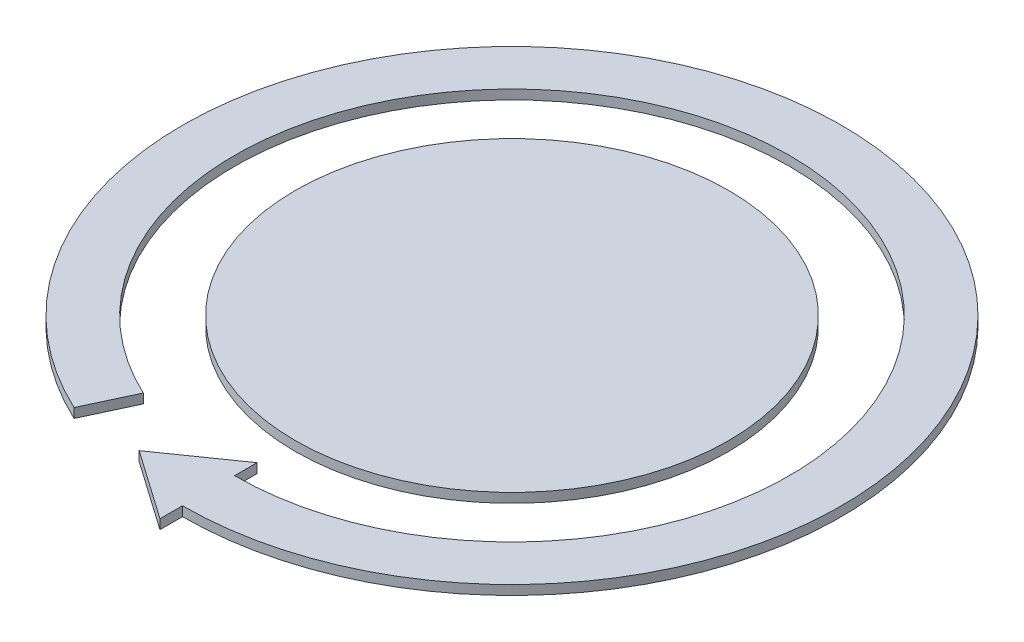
ISO-10303-21;
HEADER;
FILE_DESCRIPTION(('STEP AP214'),'2;1');
FILE_NAME('part.step','',(''),(''),'','','');
FILE_SCHEMA(('AUTOMOTIVE_DESIGN { 1 0 10303 214 1 1 1 1 }'));
ENDSEC;
DATA;
#1=APPLICATION_CONTEXT('core data for automotive mechanical design processes');
#2=APPLICATION_PROTOCOL_DEFINITION('international standard','automotive_design',2000,#1);
#3=PRODUCT_CONTEXT('',#1,'mechanical');
#4=PRODUCT('Part','Part','',(#3));
#5=PRODUCT_RELATED_PRODUCT_CATEGORY('part','',(#4));
#6=PRODUCT_DEFINITION_FORMATION('','',#4);
#7=PRODUCT_DEFINITION_CONTEXT('part definition',#1,'design');
#8=PRODUCT_DEFINITION('design','',#6,#7);
#9=PRODUCT_DEFINITION_SHAPE('','',#8);
#10=(LENGTH_UNIT() NAMED_UNIT(*) SI_UNIT(.MILLI.,.METRE.));
#11=(NAMED_UNIT(*) PLANE_ANGLE_UNIT() SI_UNIT($,.RADIAN.));
#12=(NAMED_UNIT(*) SI_UNIT($,.STERADIAN.) SOLID_ANGLE_UNIT());
#13=UNCERTAINTY_MEASURE_WITH_UNIT(LENGTH_MEASURE(1.E-05),#10,'distance_accuracy_value','');
#14=(GEOMETRIC_REPRESENTATION_CONTEXT(3) GLOBAL_UNCERTAINTY_ASSIGNED_CONTEXT((#13)) GLOBAL_UNIT_ASSIGNED_CONTEXT((#10,
#11,#12)) REPRESENTATION_CONTEXT('',''));
#15=CARTESIAN_POINT('',(0.,0.,0.));
#16=DIRECTION('',(0.,0.,1.));
#17=DIRECTION('',(1.,0.,0.));
#18=AXIS2_PLACEMENT_3D('',#15,#16,#17);
#19=CARTESIAN_POINT('',(0.,2.,0.));
#20=DIRECTION('',(0.,-1.,0.));
#21=DIRECTION('',(0.,0.,-1.));
#22=AXIS2_PLACEMENT_3D('',#19,#20,#21);
#23=CYLINDRICAL_SURFACE('',#22,58.575);
#24=CARTESIAN_POINT('',(0.,0.,0.));
#25=DIRECTION('',(0.,-1.,0.));
#26=DIRECTION('',(0.,0.,1.));
#27=AXIS2_PLACEMENT_3D('',#24,#25,#26);
#28=CIRCLE('',#27,58.575);
#29=CARTESIAN_POINT('',(-24.7547550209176,0.,53.0870297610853));
#30=VERTEX_POINT('',#29);
#31=CARTESIAN_POINT('',(0.,0.,58.575));
#32=VERTEX_POINT('',#31);
#33=EDGE_CURVE('E133',#30,#32,#28,.T.);
#34=ORIENTED_EDGE('',*,*,#33,.T.);
#35=DIRECTION('',(0.,-1.,0.));
#36=VECTOR('',#35,1.);
#37=CARTESIAN_POINT('',(0.,2.,58.575));
#38=LINE('',#37,#36);
#39=CARTESIAN_POINT('',(0.,2.,58.575));
#40=VERTEX_POINT('',#39);
#41=EDGE_CURVE('E12',#40,#32,#38,.T.);
#42=ORIENTED_EDGE('',*,*,#41,.F.);
#43=CARTESIAN_POINT('',(0.,2.,0.));
#44=DIRECTION('',(0.,-1.,0.));
#45=DIRECTION('',(0.,0.,1.));
#46=AXIS2_PLACEMENT_3D('',#43,#44,#45);
#47=CIRCLE('',#46,58.575);
#48=CARTESIAN_POINT('',(-24.7547550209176,2.,53.0870297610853));
#49=VERTEX_POINT('',#48);
#50=EDGE_CURVE('E145',#49,#40,#47,.T.);
#51=ORIENTED_EDGE('',*,*,#50,.F.);
#52=DIRECTION('',(0.,-1.,0.));
#53=VECTOR('',#52,1.);
#54=CARTESIAN_POINT('',(-24.7547550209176,2.,53.0870297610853));
#55=LINE('',#54,#53);
#56=EDGE_CURVE('E129',#49,#30,#55,.T.);
#57=ORIENTED_EDGE('',*,*,#56,.T.);
#58=EDGE_LOOP('',(#34,#42,#51,#57));
#59=FACE_BOUND('',#58,.T.);
#60=ADVANCED_FACE('F43',(#59),#23,.F.);
#61=CARTESIAN_POINT('',(0.,2.,58.575));
#62=DIRECTION('',(-1.,0.,0.));
#63=DIRECTION('',(0.,0.,1.));
#64=AXIS2_PLACEMENT_3D('',#61,#62,#63);
#65=PLANE('',#64);
#66=DIRECTION('',(0.,0.,-1.));
#67=VECTOR('',#66,1.);
#68=CARTESIAN_POINT('',(0.,0.,58.575));
#69=LINE('',#68,#67);
#70=CARTESIAN_POINT('',(-1.11022302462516E-13,0.,53.8204345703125));
#71=VERTEX_POINT('',#70);
#72=EDGE_CURVE('E136',#32,#71,#69,.T.);
#73=ORIENTED_EDGE('',*,*,#72,.T.);
#74=DIRECTION('',(0.,-1.,0.));
#75=VECTOR('',#74,1.);
#76=CARTESIAN_POINT('',(-1.11022302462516E-13,2.,53.8204345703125));
#77=LINE('',#76,#75);
#78=CARTESIAN_POINT('',(-1.11022302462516E-13,2.,53.8204345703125));
#79=VERTEX_POINT('',#78);
#80=EDGE_CURVE('E51',#79,#71,#77,.T.);
#81=ORIENTED_EDGE('',*,*,#80,.F.);
#82=DIRECTION('',(0.,0.,-1.));
#83=VECTOR('',#82,1.);
#84=CARTESIAN_POINT('',(0.,2.,58.575));
#85=LINE('',#84,#83);
#86=EDGE_CURVE('E99',#40,#79,#85,.T.);
#87=ORIENTED_EDGE('',*,*,#86,.F.);
#88=ORIENTED_EDGE('',*,*,#41,.T.);
#89=EDGE_LOOP('',(#73,#81,#87,#88));
#90=FACE_BOUND('',#89,.T.);
#91=ADVANCED_FACE('F170',(#90),#65,.F.);
#92=CARTESIAN_POINT('',(-14.6406090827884,2.,64.0718994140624));
#93=DIRECTION('',(0.573576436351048,0.,0.819152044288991));
#94=DIRECTION('',(0.819152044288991,0.,-0.573576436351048));
#95=AXIS2_PLACEMENT_3D('',#92,#93,#94);
#96=PLANE('',#95);
#97=DIRECTION('',(-0.819152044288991,0.,0.573576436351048));
#98=VECTOR('',#97,1.);
#99=CARTESIAN_POINT('',(-14.6406090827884,0.,64.0718994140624));
#100=LINE('',#99,#98);
#101=CARTESIAN_POINT('',(-14.6406090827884,0.,64.0718994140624));
#102=VERTEX_POINT('',#101);
#103=EDGE_CURVE('E138',#71,#102,#100,.T.);
#104=ORIENTED_EDGE('',*,*,#103,.T.);
#105=DIRECTION('',(0.,-1.,0.));
#106=VECTOR('',#105,1.);
#107=CARTESIAN_POINT('',(-14.6406090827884,2.,64.0718994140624));
#108=LINE('',#107,#106);
#109=CARTESIAN_POINT('',(-14.6406090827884,2.,64.0718994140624));
#110=VERTEX_POINT('',#109);
#111=EDGE_CURVE('E149',#110,#102,#108,.T.);
#112=ORIENTED_EDGE('',*,*,#111,.F.);
#113=DIRECTION('',(-0.819152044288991,0.,0.573576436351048));
#114=VECTOR('',#113,1.);
#115=CARTESIAN_POINT('',(-14.6406090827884,2.,64.0718994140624));
#116=LINE('',#115,#114);
#117=EDGE_CURVE('E157',#79,#110,#116,.T.);
#118=ORIENTED_EDGE('',*,*,#117,.F.);
#119=ORIENTED_EDGE('',*,*,#80,.T.);
#120=EDGE_LOOP('',(#104,#112,#118,#119));
#121=FACE_BOUND('',#120,.T.);
#122=ADVANCED_FACE('F155',(#121),#96,.F.);
#123=CARTESIAN_POINT('',(-14.6406090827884,2.,64.0718994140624));
#124=DIRECTION('',(0.57357643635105,0.,-0.819152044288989));
#125=DIRECTION('',(-0.819152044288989,0.,-0.57357643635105));
#126=AXIS2_PLACEMENT_3D('',#123,#124,#125);
#127=PLANE('',#126);
#128=DIRECTION('',(0.819152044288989,0.,0.57357643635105));
#129=VECTOR('',#128,1.);
#130=CARTESIAN_POINT('',(-14.6406090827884,0.,64.0718994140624));
#131=LINE('',#130,#129);
#132=CARTESIAN_POINT('',(0.,0.,74.3233642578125));
#133=VERTEX_POINT('',#132);
#134=EDGE_CURVE('E140',#102,#133,#131,.T.);
#135=ORIENTED_EDGE('',*,*,#134,.T.);
#136=DIRECTION('',(0.,-1.,0.));
#137=VECTOR('',#136,1.);
#138=CARTESIAN_POINT('',(0.,2.,74.3233642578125));
#139=LINE('',#138,#137);
#140=CARTESIAN_POINT('',(0.,2.,74.3233642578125));
#141=VERTEX_POINT('',#140);
#142=EDGE_CURVE('E124',#141,#133,#139,.T.);
#143=ORIENTED_EDGE('',*,*,#142,.F.);
#144=DIRECTION('',(0.819152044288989,0.,0.57357643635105));
#145=VECTOR('',#144,1.);
#146=CARTESIAN_POINT('',(-14.6406090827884,2.,64.0718994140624));
#147=LINE('',#146,#145);
#148=EDGE_CURVE('E115',#110,#141,#147,.T.);
#149=ORIENTED_EDGE('',*,*,#148,.F.);
#150=ORIENTED_EDGE('',*,*,#111,.T.);
#151=EDGE_LOOP('',(#135,#143,#149,#150));
#152=FACE_BOUND('',#151,.T.);
#153=ADVANCED_FACE('F163',(#152),#127,.F.);
#154=CARTESIAN_POINT('',(0.,2.,74.3233642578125));
#155=DIRECTION('',(-1.,0.,0.));
#156=DIRECTION('',(0.,0.,1.));
#157=AXIS2_PLACEMENT_3D('',#154,#155,#156);
#158=PLANE('',#157);
#159=DIRECTION('',(0.,0.,-1.));
#160=VECTOR('',#159,1.);
#161=CARTESIAN_POINT('',(0.,0.,74.3233642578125));
#162=LINE('',#161,#160);
#163=CARTESIAN_POINT('',(0.,0.,69.575));
#164=VERTEX_POINT('',#163);
#165=EDGE_CURVE('E123',#133,#164,#162,.T.);
#166=ORIENTED_EDGE('',*,*,#165,.T.);
#167=DIRECTION('',(0.,-1.,0.));
#168=VECTOR('',#167,1.);
#169=CARTESIAN_POINT('',(0.,2.,69.575));
#170=LINE('',#169,#168);
#171=CARTESIAN_POINT('',(0.,2.,69.575));
#172=VERTEX_POINT('',#171);
#173=EDGE_CURVE('E120',#172,#164,#170,.T.);
#174=ORIENTED_EDGE('',*,*,#173,.F.);
#175=DIRECTION('',(0.,0.,-1.));
#176=VECTOR('',#175,1.);
#177=CARTESIAN_POINT('',(0.,2.,74.3233642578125));
#178=LINE('',#177,#176);
#179=EDGE_CURVE('E109',#141,#172,#178,.T.);
#180=ORIENTED_EDGE('',*,*,#179,.F.);
#181=ORIENTED_EDGE('',*,*,#142,.T.);
#182=EDGE_LOOP('',(#166,#174,#180,#181));
#183=FACE_BOUND('',#182,.T.);
#184=ADVANCED_FACE('F121',(#183),#158,.F.);
#185=CARTESIAN_POINT('',(0.,2.,0.));
#186=DIRECTION('',(0.,-1.,0.));
#187=DIRECTION('',(0.,0.,-1.));
#188=AXIS2_PLACEMENT_3D('',#185,#186,#187);
#189=CYLINDRICAL_SURFACE('',#188,69.575);
#190=CARTESIAN_POINT('',(0.,0.,0.));
#191=DIRECTION('',(0.,1.,0.));
#192=DIRECTION('',(0.,0.,1.));
#193=AXIS2_PLACEMENT_3D('',#190,#191,#192);
#194=CIRCLE('',#193,69.575);
#195=CARTESIAN_POINT('',(-29.4035353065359,0.,63.056425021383));
#196=VERTEX_POINT('',#195);
#197=EDGE_CURVE('E85',#164,#196,#194,.T.);
#198=ORIENTED_EDGE('',*,*,#197,.T.);
#199=DIRECTION('',(0.,-1.,0.));
#200=VECTOR('',#199,1.);
#201=CARTESIAN_POINT('',(-29.4035353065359,2.,63.056425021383));
#202=LINE('',#201,#200);
#203=CARTESIAN_POINT('',(-29.4035353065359,2.,63.056425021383));
#204=VERTEX_POINT('',#203);
#205=EDGE_CURVE('E125',#204,#196,#202,.T.);
#206=ORIENTED_EDGE('',*,*,#205,.F.);
#207=CARTESIAN_POINT('',(0.,2.,0.));
#208=DIRECTION('',(0.,1.,0.));
#209=DIRECTION('',(0.,0.,1.));
#210=AXIS2_PLACEMENT_3D('',#207,#208,#209);
#211=CIRCLE('',#210,69.575);
#212=EDGE_CURVE('E113',#172,#204,#211,.T.);
#213=ORIENTED_EDGE('',*,*,#212,.F.);
#214=ORIENTED_EDGE('',*,*,#173,.T.);
#215=EDGE_LOOP('',(#198,#206,#213,#214));
#216=FACE_BOUND('',#215,.T.);
#217=ADVANCED_FACE('F127',(#216),#189,.T.);
#218=CARTESIAN_POINT('',(-24.7547550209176,2.,53.0870297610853));
#219=DIRECTION('',(-0.906308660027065,0.,-0.422616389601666));
#220=DIRECTION('',(-0.422616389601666,0.,0.906308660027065));
#221=AXIS2_PLACEMENT_3D('',#218,#219,#220);
#222=PLANE('',#221);
#223=DIRECTION('',(0.422616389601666,0.,-0.906308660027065));
#224=VECTOR('',#223,1.);
#225=CARTESIAN_POINT('',(-24.7547550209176,0.,53.0870297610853));
#226=LINE('',#225,#224);
#227=EDGE_CURVE('E91',#196,#30,#226,.T.);
#228=ORIENTED_EDGE('',*,*,#227,.T.);
#229=ORIENTED_EDGE('',*,*,#56,.F.);
#230=DIRECTION('',(0.422616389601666,0.,-0.906308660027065));
#231=VECTOR('',#230,1.);
#232=CARTESIAN_POINT('',(-24.7547550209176,2.,53.0870297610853));
#233=LINE('',#232,#231);
#234=EDGE_CURVE('E59',#204,#49,#233,.T.);
#235=ORIENTED_EDGE('',*,*,#234,.F.);
#236=ORIENTED_EDGE('',*,*,#205,.T.);
#237=EDGE_LOOP('',(#228,#229,#235,#236));
#238=FACE_BOUND('',#237,.T.);
#239=ADVANCED_FACE('F184',(#238),#222,.F.);
#240=CARTESIAN_POINT('',(0.,2.,0.));
#241=DIRECTION('',(0.,1.,0.));
#242=DIRECTION('',(0.,0.,1.));
#243=AXIS2_PLACEMENT_3D('',#240,#241,#242);
#244=PLANE('',#243);
#245=ORIENTED_EDGE('',*,*,#50,.T.);
#246=ORIENTED_EDGE('',*,*,#86,.T.);
#247=ORIENTED_EDGE('',*,*,#117,.T.);
#248=ORIENTED_EDGE('',*,*,#148,.T.);
#249=ORIENTED_EDGE('',*,*,#179,.T.);
#250=ORIENTED_EDGE('',*,*,#212,.T.);
#251=ORIENTED_EDGE('',*,*,#234,.T.);
#252=EDGE_LOOP('',(#245,#246,#247,#248,#249,#250,#251));
#253=FACE_BOUND('',#252,.T.);
#254=ADVANCED_FACE('F111',(#253),#244,.T.);
#255=CARTESIAN_POINT('',(0.,0.,0.));
#256=DIRECTION('',(0.,1.,0.));
#257=DIRECTION('',(0.,0.,1.));
#258=AXIS2_PLACEMENT_3D('',#255,#256,#257);
#259=PLANE('',#258);
#260=ORIENTED_EDGE('',*,*,#33,.F.);
#261=ORIENTED_EDGE('',*,*,#227,.F.);
#262=ORIENTED_EDGE('',*,*,#197,.F.);
#263=ORIENTED_EDGE('',*,*,#165,.F.);
#264=ORIENTED_EDGE('',*,*,#134,.F.);
#265=ORIENTED_EDGE('',*,*,#103,.F.);
#266=ORIENTED_EDGE('',*,*,#72,.F.);
#267=EDGE_LOOP('',(#260,#261,#262,#263,#264,#265,#266));
#268=FACE_BOUND('',#267,.T.);
#269=ADVANCED_FACE('F161',(#268),#259,.F.);
#270=CLOSED_SHELL('',(#60,#91,#122,#153,#184,#217,#239,#254,#269));
#271=MANIFOLD_SOLID_BREP('B2',#270);
#272=CARTESIAN_POINT('',(0.,2.,0.));
#273=DIRECTION('',(0.,-1.,0.));
#274=DIRECTION('',(0.,0.,-1.));
#275=AXIS2_PLACEMENT_3D('',#272,#273,#274);
#276=CYLINDRICAL_SURFACE('',#275,45.75);
#277=CARTESIAN_POINT('',(0.,2.,0.));
#278=DIRECTION('',(0.,1.,0.));
#279=DIRECTION('',(0.,0.,1.));
#280=AXIS2_PLACEMENT_3D('',#277,#278,#279);
#281=CIRCLE('',#280,45.75);
#282=CARTESIAN_POINT('',(0.,2.,45.75));
#283=VERTEX_POINT('',#282);
#284=EDGE_CURVE('E42',#283,#283,#281,.T.);
#285=ORIENTED_EDGE('',*,*,#284,.F.);
#286=EDGE_LOOP('',(#285));
#287=FACE_BOUND('',#286,.T.);
#288=CARTESIAN_POINT('',(0.,0.,0.));
#289=DIRECTION('',(0.,1.,0.));
#290=DIRECTION('',(0.,0.,1.));
#291=AXIS2_PLACEMENT_3D('',#288,#289,#290);
#292=CIRCLE('',#291,45.75);
#293=CARTESIAN_POINT('',(0.,0.,45.75));
#294=VERTEX_POINT('',#293);
#295=EDGE_CURVE('E248',#294,#294,#292,.T.);
#296=ORIENTED_EDGE('',*,*,#295,.T.);
#297=EDGE_LOOP('',(#296));
#298=FACE_BOUND('',#297,.T.);
#299=ADVANCED_FACE('F245',(#287,#298),#276,.T.);
#300=CARTESIAN_POINT('',(0.,2.,0.));
#301=DIRECTION('',(0.,1.,0.));
#302=DIRECTION('',(0.,0.,1.));
#303=AXIS2_PLACEMENT_3D('',#300,#301,#302);
#304=PLANE('',#303);
#305=ORIENTED_EDGE('',*,*,#284,.T.);
#306=EDGE_LOOP('',(#305));
#307=FACE_BOUND('',#306,.T.);
#308=ADVANCED_FACE('F260',(#307),#304,.T.);
#309=CARTESIAN_POINT('',(0.,0.,0.));
#310=DIRECTION('',(0.,1.,0.));
#311=DIRECTION('',(0.,0.,1.));
#312=AXIS2_PLACEMENT_3D('',#309,#310,#311);
#313=PLANE('',#312);
#314=ORIENTED_EDGE('',*,*,#295,.F.);
#315=EDGE_LOOP('',(#314));
#316=FACE_BOUND('',#315,.T.);
#317=ADVANCED_FACE('F258',(#316),#313,.F.);
#318=CLOSED_SHELL('',(#299,#308,#317));
#319=MANIFOLD_SOLID_BREP('B6',#318);
#320=ADVANCED_BREP_SHAPE_REPRESENTATION('',(#18,#271,#319),#14);
#321=SHAPE_DEFINITION_REPRESENTATION(#9,#320);
ENDSEC;
END-ISO-10303-21;
